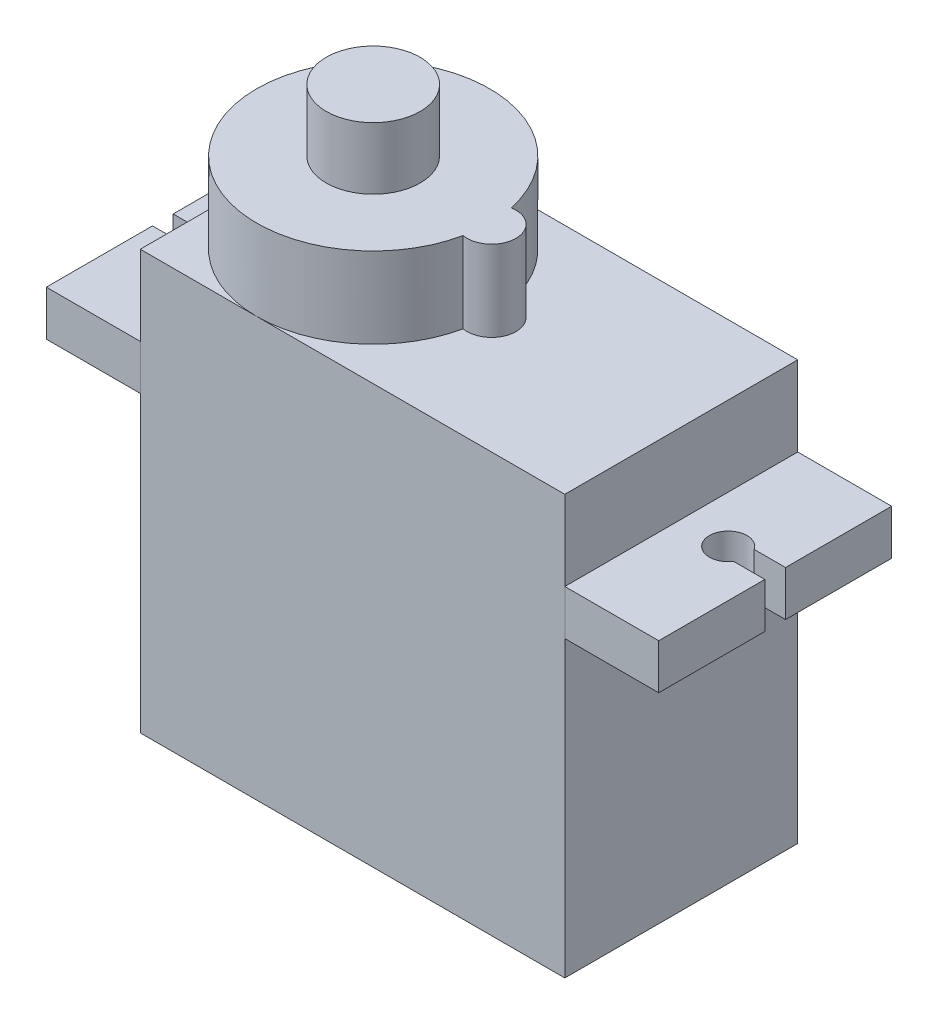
from build123d import *

# Parameters (mm, degrees)
SKETCH1_W             = 22.6
SKETCH1_H             = 12.4
BOSS_EXTRUDE1_DEPTH   = 22.3
SKETCH2_W             = 12.4
SKETCH2_H             = 2.4
BOSS_EXTRUDE2_DEPTH   = 5
SKETCH3_W             = 12.4
SKETCH3_H             = 2.4
BOSS_EXTRUDE3_DEPTH   = 5
CUT_EXTRUDE1_DEPTH    = 2.4
CUT_EXTRUDE2_DEPTH    = 2.4
BOSS_EXTRUDE4_DEPTH   = 4.3
SKETCH7_R             = 2.5
BOSS_EXTRUDE5_DEPTH   = 3.3
SKETCH8_R             = 0.6
BOSS_EXTRUDE7_DEPTH   = 2.3
BOSS_EXTRUDE7_2_DEPTH = 2.3
BOSS_EXTRUDE7_3_DEPTH = 2.3


with BuildPart() as part:
    # Sketch1 → Boss-Extrude1 (new body)
    with BuildSketch(Plane(origin=(0, 0, 0), x_dir=(1, 0, 0), z_dir=(0, 1, 0))):
        Rectangle(SKETCH1_W, SKETCH1_H)
    extrude(amount=BOSS_EXTRUDE1_DEPTH)

    # Sketch6 → Boss-Extrude4 (add)
    with BuildSketch(Plane(origin=(0, 22.3, 0), x_dir=(1, 0, 0), z_dir=(0, 1, 0))):
        with BuildLine():
            ThreePointArc((0.966666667, -1.278888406), (2.5, 0), (0.966666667, 1.278888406))
            ThreePointArc((0.966666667, 1.278888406), (-11.3, 0), (0.966666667, -1.278888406))
        make_face()
    extrude(amount=BOSS_EXTRUDE4_DEPTH)

    # Sketch7 → Boss-Extrude5 (add)
    with BuildSketch(Plane(origin=(0, 26.6, 0), x_dir=(1, 0, 0), z_dir=(0, 1, 0))):
        with Locations(Location((-5.1, 0, 0), (0, 0, 270))):
            Circle(SKETCH7_R)
    extrude(amount=BOSS_EXTRUDE5_DEPTH)


with BuildPart() as body_2:
    # Sketch2 → Boss-Extrude2 (new body)
    with BuildSketch(Plane(origin=(11.3, 0, 0), x_dir=(0, 0, -1), z_dir=(1, 0, 0))):
        with Locations((0, 16.85)):
            Rectangle(SKETCH2_W, SKETCH2_H)
    extrude(amount=BOSS_EXTRUDE2_DEPTH)

    # Sketch5 → Cut-Extrude2 (cut)
    with BuildSketch(Plane(origin=(0, 18.05, 0), x_dir=(1, 0, 0), z_dir=(0, 1, 0))):
        with BuildLine():
            Line((14.635164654, 0.55), (16.3, 0.55))
            Line((16.3, 0.55), (16.3, -0.55))
            Line((16.3, -0.55), (14.635164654, -0.55))
            ThreePointArc((14.635164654, -0.55), (12.8, 0), (14.635164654, 0.55))
        make_face()
    extrude(amount=-CUT_EXTRUDE2_DEPTH, mode=Mode.SUBTRACT)


with BuildPart() as body_3:
    # Sketch3 → Boss-Extrude3 (new body)
    with BuildSketch(Plane.ZY.offset(11.3)):
        with Locations((0, 16.85)):
            Rectangle(SKETCH3_W, SKETCH3_H)
    extrude(amount=BOSS_EXTRUDE3_DEPTH)

    # Sketch4 → Cut-Extrude1 (cut)
    with BuildSketch(Plane(origin=(0, 18.05, 0), x_dir=(1, 0, 0), z_dir=(0, 1, 0))):
        with BuildLine():
            Line((-16.3, 0.55), (-14.635164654, 0.55))
            ThreePointArc((-14.635164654, 0.55), (-12.8, 0), (-14.635164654, -0.55))
            Line((-14.635164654, -0.55), (-16.3, -0.55))
            Line((-16.3, -0.55), (-16.3, 0.55))
        make_face()
        with BuildLine():
            Line((16.3, -0.55), (14.635164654, -0.55))
            ThreePointArc((14.635164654, -0.55), (12.8, 0), (14.635164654, 0.55))
            Line((14.635164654, 0.55), (16.3, 0.55))
            Line((16.3, 0.55), (16.3, -0.55))
        make_face()
    extrude(amount=-CUT_EXTRUDE1_DEPTH, mode=Mode.SUBTRACT)


with BuildPart() as body_4:
    # Sketch8 → Boss-Extrude7 (new body)
    with BuildSketch(Plane.ZY.offset(11.3)):
        with Locations((0, 4.5)):
            Circle(SKETCH8_R)
    extrude(amount=BOSS_EXTRUDE7_DEPTH)


with BuildPart() as body_5:
    # Sketch8 → Boss-Extrude7 2 (new body)
    with BuildSketch(Plane.ZY.offset(11.3)):
        with Locations((-1.2, 4.5)):
            Circle(SKETCH8_R)
    extrude(amount=BOSS_EXTRUDE7_2_DEPTH)


with BuildPart() as body_6:
    # Sketch8 → Boss-Extrude7 3 (new body)
    with BuildSketch(Plane.ZY.offset(11.3)):
        with Locations((1.2, 4.5)):
            Circle(SKETCH8_R)
    extrude(amount=BOSS_EXTRUDE7_3_DEPTH)


solid = Compound([part.part, body_2.part, body_3.part, body_4.part, body_5.part, body_6.part])
